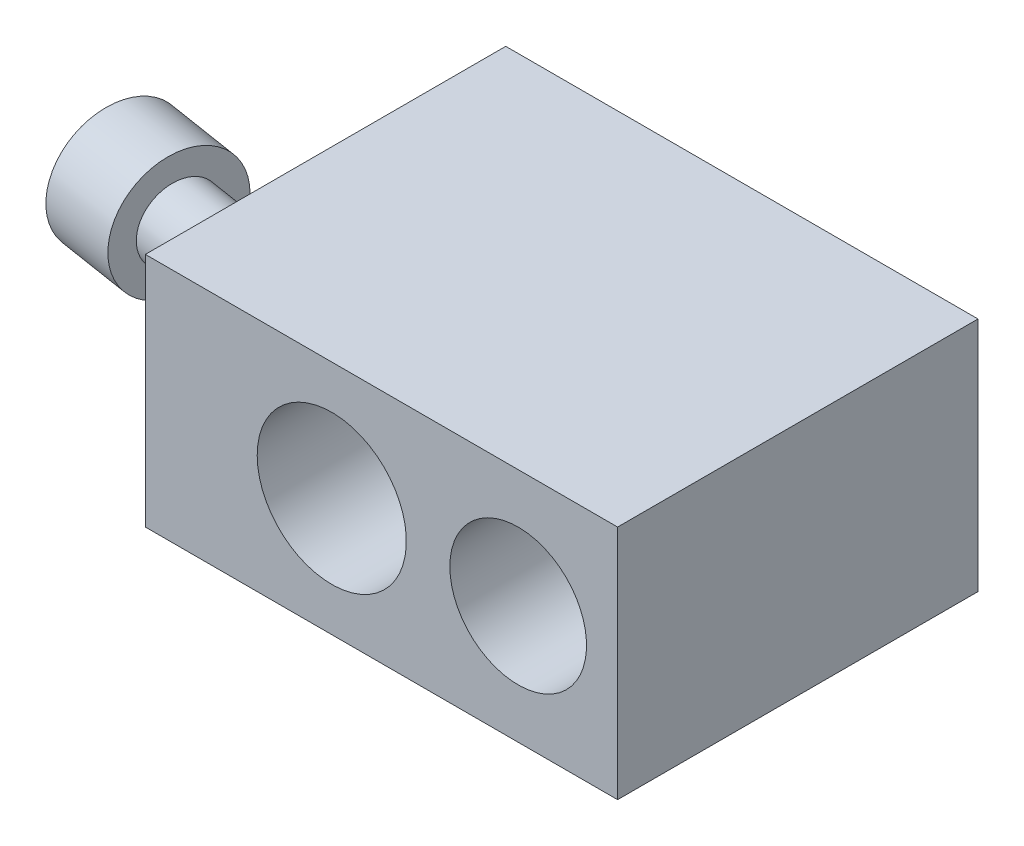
ISO-10303-21;
HEADER;
FILE_DESCRIPTION(('STEP AP214'),'2;1');
FILE_NAME('part.step','',(''),(''),'','','');
FILE_SCHEMA(('AUTOMOTIVE_DESIGN { 1 0 10303 214 1 1 1 1 }'));
ENDSEC;
DATA;
#1=APPLICATION_CONTEXT('core data for automotive mechanical design processes');
#2=APPLICATION_PROTOCOL_DEFINITION('international standard','automotive_design',2000,#1);
#3=PRODUCT_CONTEXT('',#1,'mechanical');
#4=PRODUCT('Part','Part','',(#3));
#5=PRODUCT_RELATED_PRODUCT_CATEGORY('part','',(#4));
#6=PRODUCT_DEFINITION_FORMATION('','',#4);
#7=PRODUCT_DEFINITION_CONTEXT('part definition',#1,'design');
#8=PRODUCT_DEFINITION('design','',#6,#7);
#9=PRODUCT_DEFINITION_SHAPE('','',#8);
#10=(LENGTH_UNIT() NAMED_UNIT(*) SI_UNIT(.MILLI.,.METRE.));
#11=(NAMED_UNIT(*) PLANE_ANGLE_UNIT() SI_UNIT($,.RADIAN.));
#12=(NAMED_UNIT(*) SI_UNIT($,.STERADIAN.) SOLID_ANGLE_UNIT());
#13=UNCERTAINTY_MEASURE_WITH_UNIT(LENGTH_MEASURE(1.E-05),#10,'distance_accuracy_value','');
#14=(GEOMETRIC_REPRESENTATION_CONTEXT(3) GLOBAL_UNCERTAINTY_ASSIGNED_CONTEXT((#13)) GLOBAL_UNIT_ASSIGNED_CONTEXT((#10,
#11,#12)) REPRESENTATION_CONTEXT('',''));
#15=CARTESIAN_POINT('',(0.,0.,0.));
#16=DIRECTION('',(0.,0.,1.));
#17=DIRECTION('',(1.,0.,0.));
#18=AXIS2_PLACEMENT_3D('',#15,#16,#17);
#19=CARTESIAN_POINT('',(-41.,0.,15.8577711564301));
#20=DIRECTION('',(-0.987688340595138,0.,-0.156434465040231));
#21=DIRECTION('',(0.156434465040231,0.,-0.987688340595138));
#22=AXIS2_PLACEMENT_3D('',#19,#20,#21);
#23=CYLINDRICAL_SURFACE('',#22,5.);
#24=CARTESIAN_POINT('',(-40.3337100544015,0.,15.9633011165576));
#25=DIRECTION('',(-0.987688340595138,0.,-0.156434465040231));
#26=DIRECTION('',(0.156434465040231,0.,-0.987688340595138));
#27=AXIS2_PLACEMENT_3D('',#24,#25,#26);
#28=CIRCLE('',#27,5.);
#29=CARTESIAN_POINT('',(-39.5515377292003,0.,11.0248594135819));
#30=VERTEX_POINT('',#29);
#31=EDGE_CURVE('E174',#30,#30,#28,.T.);
#32=ORIENTED_EDGE('',*,*,#31,.T.);
#33=EDGE_LOOP('',(#32));
#34=FACE_BOUND('',#33,.T.);
#35=CARTESIAN_POINT('',(-46.2598400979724,0.,15.0246943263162));
#36=DIRECTION('',(-0.987688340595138,0.,-0.156434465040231));
#37=DIRECTION('',(0.156434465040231,0.,-0.987688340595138));
#38=AXIS2_PLACEMENT_3D('',#35,#36,#37);
#39=CIRCLE('',#38,5.);
#40=CARTESIAN_POINT('',(-45.4776677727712,0.,10.0862526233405));
#41=VERTEX_POINT('',#40);
#42=EDGE_CURVE('E155',#41,#41,#39,.T.);
#43=ORIENTED_EDGE('',*,*,#42,.F.);
#44=EDGE_LOOP('',(#43));
#45=FACE_BOUND('',#44,.T.);
#46=ADVANCED_FACE('F14',(#34,#45),#23,.T.);
#47=CARTESIAN_POINT('',(-41.1158823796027,0.,20.9017428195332));
#48=DIRECTION('',(0.987688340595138,0.,0.156434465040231));
#49=DIRECTION('',(-0.156434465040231,0.,0.987688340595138));
#50=AXIS2_PLACEMENT_3D('',#47,#48,#49);
#51=PLANE('',#50);
#52=CARTESIAN_POINT('',(-40.3337100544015,0.,15.9633011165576));
#53=DIRECTION('',(-0.987688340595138,0.,-0.156434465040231));
#54=DIRECTION('',(0.156434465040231,0.,-0.987688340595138));
#55=AXIS2_PLACEMENT_3D('',#52,#53,#54);
#56=CIRCLE('',#55,3.);
#57=CARTESIAN_POINT('',(-39.8644066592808,0.,13.0002360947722));
#58=VERTEX_POINT('',#57);
#59=EDGE_CURVE('E171',#58,#58,#56,.T.);
#60=ORIENTED_EDGE('',*,*,#59,.T.);
#61=EDGE_LOOP('',(#60));
#62=FACE_BOUND('',#61,.T.);
#63=ORIENTED_EDGE('',*,*,#31,.F.);
#64=EDGE_LOOP('',(#63));
#65=FACE_BOUND('',#64,.T.);
#66=ADVANCED_FACE('F396',(#62,#65),#51,.T.);
#67=CARTESIAN_POINT('',(-41.,0.,15.8577711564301));
#68=DIRECTION('',(-0.987688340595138,0.,-0.156434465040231));
#69=DIRECTION('',(0.156434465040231,0.,-0.987688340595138));
#70=AXIS2_PLACEMENT_3D('',#67,#68,#69);
#71=CYLINDRICAL_SURFACE('',#70,3.);
#72=CARTESIAN_POINT('',(-30.,0.,17.6));
#73=DIRECTION('',(-1.,0.,0.));
#74=DIRECTION('',(0.,0.,-1.));
#75=AXIS2_PLACEMENT_3D('',#72,#73,#74);
#76=ELLIPSE('',#75,3.037395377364,3.);
#77=CARTESIAN_POINT('',(-30.,0.,14.562604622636));
#78=VERTEX_POINT('',#77);
#79=EDGE_CURVE('E24',#78,#78,#76,.T.);
#80=ORIENTED_EDGE('',*,*,#79,.T.);
#81=EDGE_LOOP('',(#80));
#82=FACE_BOUND('',#81,.T.);
#83=ORIENTED_EDGE('',*,*,#59,.F.);
#84=EDGE_LOOP('',(#83));
#85=FACE_BOUND('',#84,.T.);
#86=ADVANCED_FACE('F393',(#82,#85),#71,.T.);
#87=CARTESIAN_POINT('',(-47.0420124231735,0.,19.9631360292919));
#88=DIRECTION('',(0.987688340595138,0.,0.156434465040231));
#89=DIRECTION('',(-0.156434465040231,0.,0.987688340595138));
#90=AXIS2_PLACEMENT_3D('',#87,#88,#89);
#91=PLANE('',#90);
#92=DIRECTION('',(-0.135476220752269,0.5,0.855363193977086));
#93=VECTOR('',#92,1.);
#94=CARTESIAN_POINT('',(-46.2598400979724,-2.88675134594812,15.0246943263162));
#95=LINE('',#94,#93);
#96=CARTESIAN_POINT('',(-46.2598400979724,-2.88675134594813,15.0246943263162));
#97=VERTEX_POINT('',#96);
#98=CARTESIAN_POINT('',(-46.650926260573,-1.44337567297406,17.493915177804));
#99=VERTEX_POINT('',#98);
#100=EDGE_CURVE('E117',#97,#99,#95,.T.);
#101=ORIENTED_EDGE('',*,*,#100,.F.);
#102=DIRECTION('',(-0.135476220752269,-0.5,0.855363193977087));
#103=VECTOR('',#102,1.);
#104=CARTESIAN_POINT('',(-45.8687539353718,-1.44337567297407,12.5554734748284));
#105=LINE('',#104,#103);
#106=CARTESIAN_POINT('',(-45.8687539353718,-1.44337567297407,12.5554734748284));
#107=VERTEX_POINT('',#106);
#108=EDGE_CURVE('E33',#107,#97,#105,.T.);
#109=ORIENTED_EDGE('',*,*,#108,.F.);
#110=DIRECTION('',(0.,-1.,0.));
#111=VECTOR('',#110,1.);
#112=CARTESIAN_POINT('',(-45.8687539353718,1.44337567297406,12.5554734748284));
#113=LINE('',#112,#111);
#114=CARTESIAN_POINT('',(-45.8687539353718,1.44337567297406,12.5554734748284));
#115=VERTEX_POINT('',#114);
#116=EDGE_CURVE('E131',#115,#107,#113,.T.);
#117=ORIENTED_EDGE('',*,*,#116,.F.);
#118=DIRECTION('',(0.135476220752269,-0.5,-0.855363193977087));
#119=VECTOR('',#118,1.);
#120=CARTESIAN_POINT('',(-46.2598400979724,2.88675134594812,15.0246943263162));
#121=LINE('',#120,#119);
#122=CARTESIAN_POINT('',(-46.2598400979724,2.88675134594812,15.0246943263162));
#123=VERTEX_POINT('',#122);
#124=EDGE_CURVE('E128',#123,#115,#121,.T.);
#125=ORIENTED_EDGE('',*,*,#124,.F.);
#126=DIRECTION('',(0.135476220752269,0.5,-0.855363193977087));
#127=VECTOR('',#126,1.);
#128=CARTESIAN_POINT('',(-46.650926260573,1.44337567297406,17.493915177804));
#129=LINE('',#128,#127);
#130=CARTESIAN_POINT('',(-46.650926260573,1.44337567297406,17.493915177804));
#131=VERTEX_POINT('',#130);
#132=EDGE_CURVE('E125',#131,#123,#129,.T.);
#133=ORIENTED_EDGE('',*,*,#132,.F.);
#134=DIRECTION('',(0.,1.,0.));
#135=VECTOR('',#134,1.);
#136=CARTESIAN_POINT('',(-46.650926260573,-1.44337567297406,17.493915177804));
#137=LINE('',#136,#135);
#138=EDGE_CURVE('E120',#99,#131,#137,.T.);
#139=ORIENTED_EDGE('',*,*,#138,.F.);
#140=EDGE_LOOP('',(#101,#109,#117,#125,#133,#139));
#141=FACE_BOUND('',#140,.T.);
#142=ORIENTED_EDGE('',*,*,#42,.T.);
#143=EDGE_LOOP('',(#142));
#144=FACE_BOUND('',#143,.T.);
#145=ADVANCED_FACE('F356',(#141,#144),#91,.F.);
#146=CARTESIAN_POINT('',(8.,-9.5,29.));
#147=DIRECTION('',(0.,0.,-1.));
#148=DIRECTION('',(1.,0.,0.));
#149=AXIS2_PLACEMENT_3D('',#146,#147,#148);
#150=PLANE('',#149);
#151=CARTESIAN_POINT('',(0.,0.,29.));
#152=DIRECTION('',(0.,0.,1.));
#153=DIRECTION('',(-1.,0.,0.));
#154=AXIS2_PLACEMENT_3D('',#151,#152,#153);
#155=CIRCLE('',#154,5.5);
#156=CARTESIAN_POINT('',(-5.5,0.,29.));
#157=VERTEX_POINT('',#156);
#158=EDGE_CURVE('E192',#157,#157,#155,.T.);
#159=ORIENTED_EDGE('',*,*,#158,.F.);
#160=EDGE_LOOP('',(#159));
#161=FACE_BOUND('',#160,.T.);
#162=DIRECTION('',(0.,-1.,0.));
#163=VECTOR('',#162,1.);
#164=CARTESIAN_POINT('',(8.,9.5,29.));
#165=LINE('',#164,#163);
#166=CARTESIAN_POINT('',(8.,9.5,29.));
#167=VERTEX_POINT('',#166);
#168=CARTESIAN_POINT('',(8.,-9.5,29.));
#169=VERTEX_POINT('',#168);
#170=EDGE_CURVE('E208',#167,#169,#165,.T.);
#171=ORIENTED_EDGE('',*,*,#170,.F.);
#172=DIRECTION('',(1.,0.,0.));
#173=VECTOR('',#172,1.);
#174=CARTESIAN_POINT('',(-30.,9.5,29.));
#175=LINE('',#174,#173);
#176=CARTESIAN_POINT('',(-30.,9.5,29.));
#177=VERTEX_POINT('',#176);
#178=EDGE_CURVE('E199',#177,#167,#175,.T.);
#179=ORIENTED_EDGE('',*,*,#178,.F.);
#180=DIRECTION('',(0.,1.,0.));
#181=VECTOR('',#180,1.);
#182=CARTESIAN_POINT('',(-30.,-9.5,29.));
#183=LINE('',#182,#181);
#184=CARTESIAN_POINT('',(-30.,-9.5,29.));
#185=VERTEX_POINT('',#184);
#186=EDGE_CURVE('E215',#185,#177,#183,.T.);
#187=ORIENTED_EDGE('',*,*,#186,.F.);
#188=DIRECTION('',(-1.,0.,0.));
#189=VECTOR('',#188,1.);
#190=CARTESIAN_POINT('',(8.,-9.5,29.));
#191=LINE('',#190,#189);
#192=EDGE_CURVE('E212',#169,#185,#191,.T.);
#193=ORIENTED_EDGE('',*,*,#192,.F.);
#194=EDGE_LOOP('',(#171,#179,#187,#193));
#195=FACE_BOUND('',#194,.T.);
#196=CARTESIAN_POINT('',(-15.,0.,29.));
#197=DIRECTION('',(0.,0.,1.));
#198=DIRECTION('',(-1.,0.,0.));
#199=AXIS2_PLACEMENT_3D('',#196,#197,#198);
#200=CIRCLE('',#199,6.);
#201=CARTESIAN_POINT('',(-21.,0.,29.));
#202=VERTEX_POINT('',#201);
#203=EDGE_CURVE('E180',#202,#202,#200,.T.);
#204=ORIENTED_EDGE('',*,*,#203,.F.);
#205=EDGE_LOOP('',(#204));
#206=FACE_BOUND('',#205,.T.);
#207=ADVANCED_FACE('F303',(#161,#195,#206),#150,.F.);
#208=CARTESIAN_POINT('',(8.,-9.5,0.));
#209=DIRECTION('',(0.,0.,-1.));
#210=DIRECTION('',(1.,0.,0.));
#211=AXIS2_PLACEMENT_3D('',#208,#209,#210);
#212=PLANE('',#211);
#213=DIRECTION('',(0.,-1.,0.));
#214=VECTOR('',#213,1.);
#215=CARTESIAN_POINT('',(8.,9.5,0.));
#216=LINE('',#215,#214);
#217=CARTESIAN_POINT('',(8.,9.5,0.));
#218=VERTEX_POINT('',#217);
#219=CARTESIAN_POINT('',(8.,-9.5,0.));
#220=VERTEX_POINT('',#219);
#221=EDGE_CURVE('E196',#218,#220,#216,.T.);
#222=ORIENTED_EDGE('',*,*,#221,.T.);
#223=DIRECTION('',(-1.,0.,0.));
#224=VECTOR('',#223,1.);
#225=CARTESIAN_POINT('',(8.,-9.5,0.));
#226=LINE('',#225,#224);
#227=CARTESIAN_POINT('',(-30.,-9.5,0.));
#228=VERTEX_POINT('',#227);
#229=EDGE_CURVE('E200',#220,#228,#226,.T.);
#230=ORIENTED_EDGE('',*,*,#229,.T.);
#231=DIRECTION('',(0.,1.,0.));
#232=VECTOR('',#231,1.);
#233=CARTESIAN_POINT('',(-30.,-9.5,0.));
#234=LINE('',#233,#232);
#235=CARTESIAN_POINT('',(-30.,9.5,0.));
#236=VERTEX_POINT('',#235);
#237=EDGE_CURVE('E203',#228,#236,#234,.T.);
#238=ORIENTED_EDGE('',*,*,#237,.T.);
#239=DIRECTION('',(1.,0.,0.));
#240=VECTOR('',#239,1.);
#241=CARTESIAN_POINT('',(-30.,9.5,0.));
#242=LINE('',#241,#240);
#243=EDGE_CURVE('E195',#236,#218,#242,.T.);
#244=ORIENTED_EDGE('',*,*,#243,.T.);
#245=EDGE_LOOP('',(#222,#230,#238,#244));
#246=FACE_BOUND('',#245,.T.);
#247=CARTESIAN_POINT('',(0.,0.,0.));
#248=DIRECTION('',(0.,0.,1.));
#249=DIRECTION('',(-1.,0.,0.));
#250=AXIS2_PLACEMENT_3D('',#247,#248,#249);
#251=CIRCLE('',#250,3.3);
#252=CARTESIAN_POINT('',(-3.3,0.,0.));
#253=VERTEX_POINT('',#252);
#254=EDGE_CURVE('E183',#253,#253,#251,.T.);
#255=ORIENTED_EDGE('',*,*,#254,.T.);
#256=EDGE_LOOP('',(#255));
#257=FACE_BOUND('',#256,.T.);
#258=ADVANCED_FACE('F422',(#246,#257),#212,.T.);
#259=CARTESIAN_POINT('',(8.,9.5,29.));
#260=DIRECTION('',(1.,0.,0.));
#261=DIRECTION('',(0.,0.,1.));
#262=AXIS2_PLACEMENT_3D('',#259,#260,#261);
#263=PLANE('',#262);
#264=DIRECTION('',(0.,0.,-1.));
#265=VECTOR('',#264,1.);
#266=CARTESIAN_POINT('',(8.,9.5,29.));
#267=LINE('',#266,#265);
#268=EDGE_CURVE('E228',#167,#218,#267,.T.);
#269=ORIENTED_EDGE('',*,*,#268,.F.);
#270=ORIENTED_EDGE('',*,*,#170,.T.);
#271=DIRECTION('',(0.,0.,-1.));
#272=VECTOR('',#271,1.);
#273=CARTESIAN_POINT('',(8.,-9.5,29.));
#274=LINE('',#273,#272);
#275=EDGE_CURVE('E211',#169,#220,#274,.T.);
#276=ORIENTED_EDGE('',*,*,#275,.T.);
#277=ORIENTED_EDGE('',*,*,#221,.F.);
#278=EDGE_LOOP('',(#269,#270,#276,#277));
#279=FACE_BOUND('',#278,.T.);
#280=ADVANCED_FACE('F425',(#279),#263,.T.);
#281=CARTESIAN_POINT('',(-30.,9.5,29.));
#282=DIRECTION('',(0.,1.,0.));
#283=DIRECTION('',(-1.,0.,0.));
#284=AXIS2_PLACEMENT_3D('',#281,#282,#283);
#285=PLANE('',#284);
#286=DIRECTION('',(0.,0.,-1.));
#287=VECTOR('',#286,1.);
#288=CARTESIAN_POINT('',(-30.,9.5,29.));
#289=LINE('',#288,#287);
#290=EDGE_CURVE('E225',#177,#236,#289,.T.);
#291=ORIENTED_EDGE('',*,*,#290,.F.);
#292=ORIENTED_EDGE('',*,*,#178,.T.);
#293=ORIENTED_EDGE('',*,*,#268,.T.);
#294=ORIENTED_EDGE('',*,*,#243,.F.);
#295=EDGE_LOOP('',(#291,#292,#293,#294));
#296=FACE_BOUND('',#295,.T.);
#297=ADVANCED_FACE('F431',(#296),#285,.T.);
#298=CARTESIAN_POINT('',(-30.,-9.5,29.));
#299=DIRECTION('',(-1.,0.,0.));
#300=DIRECTION('',(0.,0.,-1.));
#301=AXIS2_PLACEMENT_3D('',#298,#299,#300);
#302=PLANE('',#301);
#303=ORIENTED_EDGE('',*,*,#79,.F.);
#304=EDGE_LOOP('',(#303));
#305=FACE_BOUND('',#304,.T.);
#306=DIRECTION('',(0.,0.,-1.));
#307=VECTOR('',#306,1.);
#308=CARTESIAN_POINT('',(-30.,-9.5,29.));
#309=LINE('',#308,#307);
#310=EDGE_CURVE('E222',#185,#228,#309,.T.);
#311=ORIENTED_EDGE('',*,*,#310,.F.);
#312=ORIENTED_EDGE('',*,*,#186,.T.);
#313=ORIENTED_EDGE('',*,*,#290,.T.);
#314=ORIENTED_EDGE('',*,*,#237,.F.);
#315=EDGE_LOOP('',(#311,#312,#313,#314));
#316=FACE_BOUND('',#315,.T.);
#317=ADVANCED_FACE('F292',(#305,#316),#302,.T.);
#318=CARTESIAN_POINT('',(8.,-9.5,29.));
#319=DIRECTION('',(0.,-1.,0.));
#320=DIRECTION('',(0.,0.,1.));
#321=AXIS2_PLACEMENT_3D('',#318,#319,#320);
#322=PLANE('',#321);
#323=CARTESIAN_POINT('',(-15.,-9.5,17.));
#324=DIRECTION('',(0.,-1.,0.));
#325=DIRECTION('',(0.,0.,1.));
#326=AXIS2_PLACEMENT_3D('',#323,#324,#325);
#327=CIRCLE('',#326,2.85);
#328=CARTESIAN_POINT('',(-15.,-9.5,19.85));
#329=VERTEX_POINT('',#328);
#330=EDGE_CURVE('E9',#329,#329,#327,.T.);
#331=ORIENTED_EDGE('',*,*,#330,.F.);
#332=EDGE_LOOP('',(#331));
#333=FACE_BOUND('',#332,.T.);
#334=ORIENTED_EDGE('',*,*,#192,.T.);
#335=ORIENTED_EDGE('',*,*,#310,.T.);
#336=ORIENTED_EDGE('',*,*,#229,.F.);
#337=ORIENTED_EDGE('',*,*,#275,.F.);
#338=EDGE_LOOP('',(#334,#335,#336,#337));
#339=FACE_BOUND('',#338,.T.);
#340=ADVANCED_FACE('F288',(#333,#339),#322,.T.);
#341=CARTESIAN_POINT('',(0.,0.,29.));
#342=DIRECTION('',(0.,0.,1.));
#343=DIRECTION('',(-1.,0.,0.));
#344=AXIS2_PLACEMENT_3D('',#341,#342,#343);
#345=CYLINDRICAL_SURFACE('',#344,5.5);
#346=ORIENTED_EDGE('',*,*,#158,.T.);
#347=EDGE_LOOP('',(#346));
#348=FACE_BOUND('',#347,.T.);
#349=CARTESIAN_POINT('',(0.,0.,15.));
#350=DIRECTION('',(0.,0.,1.));
#351=DIRECTION('',(-1.,0.,0.));
#352=AXIS2_PLACEMENT_3D('',#349,#350,#351);
#353=CIRCLE('',#352,5.5);
#354=CARTESIAN_POINT('',(-5.5,0.,15.));
#355=VERTEX_POINT('',#354);
#356=EDGE_CURVE('E189',#355,#355,#353,.T.);
#357=ORIENTED_EDGE('',*,*,#356,.F.);
#358=EDGE_LOOP('',(#357));
#359=FACE_BOUND('',#358,.T.);
#360=ADVANCED_FACE('F291',(#348,#359),#345,.F.);
#361=CARTESIAN_POINT('',(-3.3,0.,15.));
#362=DIRECTION('',(0.,0.,1.));
#363=DIRECTION('',(-1.,0.,0.));
#364=AXIS2_PLACEMENT_3D('',#361,#362,#363);
#365=PLANE('',#364);
#366=ORIENTED_EDGE('',*,*,#356,.T.);
#367=EDGE_LOOP('',(#366));
#368=FACE_BOUND('',#367,.T.);
#369=CARTESIAN_POINT('',(0.,0.,15.));
#370=DIRECTION('',(0.,0.,1.));
#371=DIRECTION('',(-1.,0.,0.));
#372=AXIS2_PLACEMENT_3D('',#369,#370,#371);
#373=CIRCLE('',#372,3.3);
#374=CARTESIAN_POINT('',(-3.3,0.,15.));
#375=VERTEX_POINT('',#374);
#376=EDGE_CURVE('E186',#375,#375,#373,.T.);
#377=ORIENTED_EDGE('',*,*,#376,.F.);
#378=EDGE_LOOP('',(#377));
#379=FACE_BOUND('',#378,.T.);
#380=ADVANCED_FACE('F414',(#368,#379),#365,.T.);
#381=CARTESIAN_POINT('',(0.,0.,29.));
#382=DIRECTION('',(0.,0.,1.));
#383=DIRECTION('',(-1.,0.,0.));
#384=AXIS2_PLACEMENT_3D('',#381,#382,#383);
#385=CYLINDRICAL_SURFACE('',#384,3.3);
#386=ORIENTED_EDGE('',*,*,#376,.T.);
#387=EDGE_LOOP('',(#386));
#388=FACE_BOUND('',#387,.T.);
#389=ORIENTED_EDGE('',*,*,#254,.F.);
#390=EDGE_LOOP('',(#389));
#391=FACE_BOUND('',#390,.T.);
#392=ADVANCED_FACE('F410',(#388,#391),#385,.F.);
#393=CARTESIAN_POINT('',(-15.,0.,29.));
#394=DIRECTION('',(0.,0.,1.));
#395=DIRECTION('',(-1.,0.,0.));
#396=AXIS2_PLACEMENT_3D('',#393,#394,#395);
#397=CYLINDRICAL_SURFACE('',#396,6.);
#398=ORIENTED_EDGE('',*,*,#203,.T.);
#399=EDGE_LOOP('',(#398));
#400=FACE_BOUND('',#399,.T.);
#401=CARTESIAN_POINT('',(-15.,0.,6.));
#402=DIRECTION('',(0.,0.,1.));
#403=DIRECTION('',(-1.,0.,0.));
#404=AXIS2_PLACEMENT_3D('',#401,#402,#403);
#405=CIRCLE('',#404,6.);
#406=CARTESIAN_POINT('',(-21.,0.,6.));
#407=VERTEX_POINT('',#406);
#408=EDGE_CURVE('E177',#407,#407,#405,.T.);
#409=ORIENTED_EDGE('',*,*,#408,.F.);
#410=EDGE_LOOP('',(#409));
#411=FACE_BOUND('',#410,.T.);
#412=ADVANCED_FACE('F406',(#400,#411),#397,.F.);
#413=CARTESIAN_POINT('',(-17.75,0.,6.));
#414=DIRECTION('',(0.,0.,1.));
#415=DIRECTION('',(-1.,0.,0.));
#416=AXIS2_PLACEMENT_3D('',#413,#414,#415);
#417=PLANE('',#416);
#418=ORIENTED_EDGE('',*,*,#408,.T.);
#419=EDGE_LOOP('',(#418));
#420=FACE_BOUND('',#419,.T.);
#421=ADVANCED_FACE('F390',(#420),#417,.T.);
#422=CARTESIAN_POINT('',(-42.9056889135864,-1.44337567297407,13.0247768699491));
#423=DIRECTION('',(0.0782172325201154,-0.866025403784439,-0.493844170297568));
#424=DIRECTION('',(0.,-0.495361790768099,0.868686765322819));
#425=AXIS2_PLACEMENT_3D('',#422,#423,#424);
#426=PLANE('',#425);
#427=ORIENTED_EDGE('',*,*,#108,.T.);
#428=DIRECTION('',(-0.987688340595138,0.,-0.156434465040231));
#429=VECTOR('',#428,1.);
#430=CARTESIAN_POINT('',(-43.296775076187,-2.88675134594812,15.4939977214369));
#431=LINE('',#430,#429);
#432=CARTESIAN_POINT('',(-43.296775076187,-2.88675134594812,15.4939977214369));
#433=VERTEX_POINT('',#432);
#434=EDGE_CURVE('E152',#433,#97,#431,.T.);
#435=ORIENTED_EDGE('',*,*,#434,.F.);
#436=DIRECTION('',(-0.135476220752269,-0.5,0.855363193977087));
#437=VECTOR('',#436,1.);
#438=CARTESIAN_POINT('',(-42.9056889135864,-1.44337567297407,13.0247768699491));
#439=LINE('',#438,#437);
#440=CARTESIAN_POINT('',(-42.9056889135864,-1.44337567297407,13.0247768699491));
#441=VERTEX_POINT('',#440);
#442=EDGE_CURVE('E134',#441,#433,#439,.T.);
#443=ORIENTED_EDGE('',*,*,#442,.F.);
#444=DIRECTION('',(-0.987688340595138,0.,-0.156434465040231));
#445=VECTOR('',#444,1.);
#446=CARTESIAN_POINT('',(-42.9056889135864,-1.44337567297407,13.0247768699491));
#447=LINE('',#446,#445);
#448=EDGE_CURVE('E153',#441,#107,#447,.T.);
#449=ORIENTED_EDGE('',*,*,#448,.T.);
#450=EDGE_LOOP('',(#427,#435,#443,#449));
#451=FACE_BOUND('',#450,.T.);
#452=ADVANCED_FACE('F368',(#451),#426,.F.);
#453=CARTESIAN_POINT('',(-42.9056889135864,1.44337567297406,13.0247768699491));
#454=DIRECTION('',(0.156434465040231,0.,-0.987688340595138));
#455=DIRECTION('',(0.987688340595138,0.,0.156434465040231));
#456=AXIS2_PLACEMENT_3D('',#453,#454,#455);
#457=PLANE('',#456);
#458=ORIENTED_EDGE('',*,*,#116,.T.);
#459=ORIENTED_EDGE('',*,*,#448,.F.);
#460=DIRECTION('',(0.,-1.,0.));
#461=VECTOR('',#460,1.);
#462=CARTESIAN_POINT('',(-42.9056889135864,1.44337567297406,13.0247768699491));
#463=LINE('',#462,#461);
#464=CARTESIAN_POINT('',(-42.9056889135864,1.44337567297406,13.0247768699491));
#465=VERTEX_POINT('',#464);
#466=EDGE_CURVE('E149',#465,#441,#463,.T.);
#467=ORIENTED_EDGE('',*,*,#466,.F.);
#468=DIRECTION('',(-0.987688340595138,0.,-0.156434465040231));
#469=VECTOR('',#468,1.);
#470=CARTESIAN_POINT('',(-42.9056889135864,1.44337567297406,13.0247768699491));
#471=LINE('',#470,#469);
#472=EDGE_CURVE('E156',#465,#115,#471,.T.);
#473=ORIENTED_EDGE('',*,*,#472,.T.);
#474=EDGE_LOOP('',(#458,#459,#467,#473));
#475=FACE_BOUND('',#474,.T.);
#476=ADVANCED_FACE('F370',(#475),#457,.F.);
#477=CARTESIAN_POINT('',(-43.296775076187,2.88675134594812,15.4939977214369));
#478=DIRECTION('',(0.0782172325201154,0.866025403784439,-0.493844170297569));
#479=DIRECTION('',(0.,-0.495361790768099,-0.868686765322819));
#480=AXIS2_PLACEMENT_3D('',#477,#478,#479);
#481=PLANE('',#480);
#482=ORIENTED_EDGE('',*,*,#124,.T.);
#483=ORIENTED_EDGE('',*,*,#472,.F.);
#484=DIRECTION('',(0.135476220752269,-0.5,-0.855363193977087));
#485=VECTOR('',#484,1.);
#486=CARTESIAN_POINT('',(-43.296775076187,2.88675134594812,15.4939977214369));
#487=LINE('',#486,#485);
#488=CARTESIAN_POINT('',(-43.296775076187,2.88675134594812,15.4939977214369));
#489=VERTEX_POINT('',#488);
#490=EDGE_CURVE('E146',#489,#465,#487,.T.);
#491=ORIENTED_EDGE('',*,*,#490,.F.);
#492=DIRECTION('',(-0.987688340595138,0.,-0.156434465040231));
#493=VECTOR('',#492,1.);
#494=CARTESIAN_POINT('',(-43.296775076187,2.88675134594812,15.4939977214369));
#495=LINE('',#494,#493);
#496=EDGE_CURVE('E159',#489,#123,#495,.T.);
#497=ORIENTED_EDGE('',*,*,#496,.T.);
#498=EDGE_LOOP('',(#482,#483,#491,#497));
#499=FACE_BOUND('',#498,.T.);
#500=ADVANCED_FACE('F372',(#499),#481,.F.);
#501=CARTESIAN_POINT('',(-43.6878612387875,1.44337567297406,17.9632185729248));
#502=DIRECTION('',(-0.0782172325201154,0.866025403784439,0.493844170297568));
#503=DIRECTION('',(0.,0.495361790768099,-0.868686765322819));
#504=AXIS2_PLACEMENT_3D('',#501,#502,#503);
#505=PLANE('',#504);
#506=ORIENTED_EDGE('',*,*,#132,.T.);
#507=ORIENTED_EDGE('',*,*,#496,.F.);
#508=DIRECTION('',(0.135476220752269,0.5,-0.855363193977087));
#509=VECTOR('',#508,1.);
#510=CARTESIAN_POINT('',(-43.6878612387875,1.44337567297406,17.9632185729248));
#511=LINE('',#510,#509);
#512=CARTESIAN_POINT('',(-43.6878612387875,1.44337567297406,17.9632185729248));
#513=VERTEX_POINT('',#512);
#514=EDGE_CURVE('E143',#513,#489,#511,.T.);
#515=ORIENTED_EDGE('',*,*,#514,.F.);
#516=DIRECTION('',(-0.987688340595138,0.,-0.156434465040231));
#517=VECTOR('',#516,1.);
#518=CARTESIAN_POINT('',(-43.6878612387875,1.44337567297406,17.9632185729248));
#519=LINE('',#518,#517);
#520=EDGE_CURVE('E162',#513,#131,#519,.T.);
#521=ORIENTED_EDGE('',*,*,#520,.T.);
#522=EDGE_LOOP('',(#506,#507,#515,#521));
#523=FACE_BOUND('',#522,.T.);
#524=ADVANCED_FACE('F361',(#523),#505,.F.);
#525=CARTESIAN_POINT('',(-43.6878612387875,-1.44337567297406,17.9632185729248));
#526=DIRECTION('',(-0.156434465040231,0.,0.987688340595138));
#527=DIRECTION('',(-0.987688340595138,0.,-0.156434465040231));
#528=AXIS2_PLACEMENT_3D('',#525,#526,#527);
#529=PLANE('',#528);
#530=ORIENTED_EDGE('',*,*,#138,.T.);
#531=ORIENTED_EDGE('',*,*,#520,.F.);
#532=DIRECTION('',(0.,1.,0.));
#533=VECTOR('',#532,1.);
#534=CARTESIAN_POINT('',(-43.6878612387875,-1.44337567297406,17.9632185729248));
#535=LINE('',#534,#533);
#536=CARTESIAN_POINT('',(-43.6878612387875,-1.44337567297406,17.9632185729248));
#537=VERTEX_POINT('',#536);
#538=EDGE_CURVE('E140',#537,#513,#535,.T.);
#539=ORIENTED_EDGE('',*,*,#538,.F.);
#540=DIRECTION('',(-0.987688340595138,0.,-0.156434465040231));
#541=VECTOR('',#540,1.);
#542=CARTESIAN_POINT('',(-43.6878612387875,-1.44337567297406,17.9632185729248));
#543=LINE('',#542,#541);
#544=EDGE_CURVE('E165',#537,#99,#543,.T.);
#545=ORIENTED_EDGE('',*,*,#544,.T.);
#546=EDGE_LOOP('',(#530,#531,#539,#545));
#547=FACE_BOUND('',#546,.T.);
#548=ADVANCED_FACE('F348',(#547),#529,.F.);
#549=CARTESIAN_POINT('',(-43.296775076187,-2.88675134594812,15.4939977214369));
#550=DIRECTION('',(-0.0782172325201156,-0.866025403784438,0.493844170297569));
#551=DIRECTION('',(0.,0.4953617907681,0.868686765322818));
#552=AXIS2_PLACEMENT_3D('',#549,#550,#551);
#553=PLANE('',#552);
#554=ORIENTED_EDGE('',*,*,#100,.T.);
#555=ORIENTED_EDGE('',*,*,#544,.F.);
#556=DIRECTION('',(-0.135476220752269,0.5,0.855363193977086));
#557=VECTOR('',#556,1.);
#558=CARTESIAN_POINT('',(-43.296775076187,-2.88675134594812,15.4939977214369));
#559=LINE('',#558,#557);
#560=EDGE_CURVE('E137',#433,#537,#559,.T.);
#561=ORIENTED_EDGE('',*,*,#560,.F.);
#562=ORIENTED_EDGE('',*,*,#434,.T.);
#563=EDGE_LOOP('',(#554,#555,#561,#562));
#564=FACE_BOUND('',#563,.T.);
#565=ADVANCED_FACE('F354',(#564),#553,.F.);
#566=CARTESIAN_POINT('',(-42.9056889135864,-1.44337567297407,13.0247768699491));
#567=DIRECTION('',(0.987688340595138,0.,0.156434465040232));
#568=DIRECTION('',(-0.156434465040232,0.,0.987688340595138));
#569=AXIS2_PLACEMENT_3D('',#566,#567,#568);
#570=PLANE('',#569);
#571=ORIENTED_EDGE('',*,*,#442,.T.);
#572=ORIENTED_EDGE('',*,*,#560,.T.);
#573=ORIENTED_EDGE('',*,*,#538,.T.);
#574=ORIENTED_EDGE('',*,*,#514,.T.);
#575=ORIENTED_EDGE('',*,*,#490,.T.);
#576=ORIENTED_EDGE('',*,*,#466,.T.);
#577=EDGE_LOOP('',(#571,#572,#573,#574,#575,#576));
#578=FACE_BOUND('',#577,.T.);
#579=ADVANCED_FACE('F365',(#578),#570,.F.);
#580=CARTESIAN_POINT('',(-15.,-10.11,17.));
#581=DIRECTION('',(0.,1.,0.));
#582=DIRECTION('',(-1.,0.,0.));
#583=AXIS2_PLACEMENT_3D('',#580,#581,#582);
#584=PLANE('',#583);
#585=DIRECTION('',(0.,0.,1.));
#586=VECTOR('',#585,1.);
#587=CARTESIAN_POINT('',(-16.,-10.11,16.4226497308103));
#588=LINE('',#587,#586);
#589=CARTESIAN_POINT('',(-16.,-10.11,16.4226497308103));
#590=VERTEX_POINT('',#589);
#591=CARTESIAN_POINT('',(-16.,-10.11,17.5773502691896));
#592=VERTEX_POINT('',#591);
#593=EDGE_CURVE('E243',#590,#592,#588,.T.);
#594=ORIENTED_EDGE('',*,*,#593,.F.);
#595=DIRECTION('',(-0.866025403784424,0.,0.50000000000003));
#596=VECTOR('',#595,1.);
#597=CARTESIAN_POINT('',(-15.,-10.11,15.8452994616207));
#598=LINE('',#597,#596);
#599=CARTESIAN_POINT('',(-15.,-10.11,15.8452994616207));
#600=VERTEX_POINT('',#599);
#601=EDGE_CURVE('E241',#600,#590,#598,.T.);
#602=ORIENTED_EDGE('',*,*,#601,.F.);
#603=DIRECTION('',(-0.866025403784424,0.,-0.50000000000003));
#604=VECTOR('',#603,1.);
#605=CARTESIAN_POINT('',(-14.,-10.11,16.4226497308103));
#606=LINE('',#605,#604);
#607=CARTESIAN_POINT('',(-14.,-10.11,16.4226497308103));
#608=VERTEX_POINT('',#607);
#609=EDGE_CURVE('E238',#608,#600,#606,.T.);
#610=ORIENTED_EDGE('',*,*,#609,.F.);
#611=DIRECTION('',(0.,0.,-1.));
#612=VECTOR('',#611,1.);
#613=CARTESIAN_POINT('',(-14.,-10.11,17.5773502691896));
#614=LINE('',#613,#612);
#615=CARTESIAN_POINT('',(-14.,-10.11,17.5773502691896));
#616=VERTEX_POINT('',#615);
#617=EDGE_CURVE('E235',#616,#608,#614,.T.);
#618=ORIENTED_EDGE('',*,*,#617,.F.);
#619=DIRECTION('',(0.866025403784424,0.,-0.50000000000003));
#620=VECTOR('',#619,1.);
#621=CARTESIAN_POINT('',(-15.,-10.11,18.1547005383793));
#622=LINE('',#621,#620);
#623=CARTESIAN_POINT('',(-15.,-10.11,18.1547005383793));
#624=VERTEX_POINT('',#623);
#625=EDGE_CURVE('E233',#624,#616,#622,.T.);
#626=ORIENTED_EDGE('',*,*,#625,.F.);
#627=DIRECTION('',(0.866025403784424,0.,0.50000000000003));
#628=VECTOR('',#627,1.);
#629=CARTESIAN_POINT('',(-16.,-10.11,17.5773502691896));
#630=LINE('',#629,#628);
#631=EDGE_CURVE('E98',#592,#624,#630,.T.);
#632=ORIENTED_EDGE('',*,*,#631,.F.);
#633=EDGE_LOOP('',(#594,#602,#610,#618,#626,#632));
#634=FACE_BOUND('',#633,.T.);
#635=ADVANCED_FACE('F261',(#634),#584,.F.);
#636=CARTESIAN_POINT('',(-14.,-10.11,17.5773502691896));
#637=DIRECTION('',(-1.,0.,0.));
#638=DIRECTION('',(0.,-1.,0.));
#639=AXIS2_PLACEMENT_3D('',#636,#637,#638);
#640=PLANE('',#639);
#641=DIRECTION('',(0.,-1.,0.));
#642=VECTOR('',#641,1.);
#643=CARTESIAN_POINT('',(-14.,-10.11,17.5773502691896));
#644=LINE('',#643,#642);
#645=CARTESIAN_POINT('',(-14.,-11.15,17.5773502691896));
#646=VERTEX_POINT('',#645);
#647=EDGE_CURVE('E89',#616,#646,#644,.T.);
#648=ORIENTED_EDGE('',*,*,#647,.F.);
#649=ORIENTED_EDGE('',*,*,#617,.T.);
#650=DIRECTION('',(0.,-1.,0.));
#651=VECTOR('',#650,1.);
#652=CARTESIAN_POINT('',(-14.,-10.11,16.4226497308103));
#653=LINE('',#652,#651);
#654=CARTESIAN_POINT('',(-14.,-11.15,16.4226497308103));
#655=VERTEX_POINT('',#654);
#656=EDGE_CURVE('E252',#608,#655,#653,.T.);
#657=ORIENTED_EDGE('',*,*,#656,.T.);
#658=DIRECTION('',(0.,0.,1.));
#659=VECTOR('',#658,1.);
#660=CARTESIAN_POINT('',(-14.,-11.15,18.));
#661=LINE('',#660,#659);
#662=EDGE_CURVE('E111',#655,#646,#661,.T.);
#663=ORIENTED_EDGE('',*,*,#662,.T.);
#664=EDGE_LOOP('',(#648,#649,#657,#663));
#665=FACE_BOUND('',#664,.T.);
#666=ADVANCED_FACE('F253',(#665),#640,.T.);
#667=CARTESIAN_POINT('',(-15.,-10.11,18.1547005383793));
#668=DIRECTION('',(-0.50000000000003,0.,-0.866025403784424));
#669=DIRECTION('',(-0.866025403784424,0.,0.50000000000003));
#670=AXIS2_PLACEMENT_3D('',#667,#668,#669);
#671=PLANE('',#670);
#672=DIRECTION('',(0.,-1.,0.));
#673=VECTOR('',#672,1.);
#674=CARTESIAN_POINT('',(-15.,-10.11,18.1547005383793));
#675=LINE('',#674,#673);
#676=CARTESIAN_POINT('',(-15.,-11.15,18.1547005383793));
#677=VERTEX_POINT('',#676);
#678=EDGE_CURVE('E87',#624,#677,#675,.T.);
#679=ORIENTED_EDGE('',*,*,#678,.F.);
#680=ORIENTED_EDGE('',*,*,#625,.T.);
#681=ORIENTED_EDGE('',*,*,#647,.T.);
#682=DIRECTION('',(-0.866025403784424,0.,0.50000000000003));
#683=VECTOR('',#682,1.);
#684=CARTESIAN_POINT('',(-14.9330127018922,-11.15,18.1160254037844));
#685=LINE('',#684,#683);
#686=EDGE_CURVE('E84',#646,#677,#685,.T.);
#687=ORIENTED_EDGE('',*,*,#686,.T.);
#688=EDGE_LOOP('',(#679,#680,#681,#687));
#689=FACE_BOUND('',#688,.T.);
#690=ADVANCED_FACE('F85',(#689),#671,.T.);
#691=CARTESIAN_POINT('',(-16.,-10.11,17.5773502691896));
#692=DIRECTION('',(0.50000000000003,0.,-0.866025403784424));
#693=DIRECTION('',(-0.866025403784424,0.,-0.50000000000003));
#694=AXIS2_PLACEMENT_3D('',#691,#692,#693);
#695=PLANE('',#694);
#696=DIRECTION('',(0.,-1.,0.));
#697=VECTOR('',#696,1.);
#698=CARTESIAN_POINT('',(-16.,-10.11,17.5773502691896));
#699=LINE('',#698,#697);
#700=CARTESIAN_POINT('',(-16.,-11.15,17.5773502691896));
#701=VERTEX_POINT('',#700);
#702=EDGE_CURVE('E99',#592,#701,#699,.T.);
#703=ORIENTED_EDGE('',*,*,#702,.F.);
#704=ORIENTED_EDGE('',*,*,#631,.T.);
#705=ORIENTED_EDGE('',*,*,#678,.T.);
#706=DIRECTION('',(-0.866025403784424,0.,-0.50000000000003));
#707=VECTOR('',#706,1.);
#708=CARTESIAN_POINT('',(-15.0669872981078,-11.15,18.1160254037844));
#709=LINE('',#708,#707);
#710=EDGE_CURVE('E77',#677,#701,#709,.T.);
#711=ORIENTED_EDGE('',*,*,#710,.T.);
#712=EDGE_LOOP('',(#703,#704,#705,#711));
#713=FACE_BOUND('',#712,.T.);
#714=ADVANCED_FACE('F96',(#713),#695,.T.);
#715=CARTESIAN_POINT('',(-16.,-10.11,16.4226497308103));
#716=DIRECTION('',(1.,0.,0.));
#717=DIRECTION('',(0.,1.,0.));
#718=AXIS2_PLACEMENT_3D('',#715,#716,#717);
#719=PLANE('',#718);
#720=ORIENTED_EDGE('',*,*,#593,.T.);
#721=ORIENTED_EDGE('',*,*,#702,.T.);
#722=DIRECTION('',(0.,0.,-1.));
#723=VECTOR('',#722,1.);
#724=CARTESIAN_POINT('',(-16.,-11.15,18.));
#725=LINE('',#724,#723);
#726=CARTESIAN_POINT('',(-16.,-11.15,16.4226497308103));
#727=VERTEX_POINT('',#726);
#728=EDGE_CURVE('E93',#701,#727,#725,.T.);
#729=ORIENTED_EDGE('',*,*,#728,.T.);
#730=DIRECTION('',(0.,-1.,0.));
#731=VECTOR('',#730,1.);
#732=CARTESIAN_POINT('',(-16.,-10.11,16.4226497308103));
#733=LINE('',#732,#731);
#734=EDGE_CURVE('E247',#590,#727,#733,.T.);
#735=ORIENTED_EDGE('',*,*,#734,.F.);
#736=EDGE_LOOP('',(#720,#721,#729,#735));
#737=FACE_BOUND('',#736,.T.);
#738=ADVANCED_FACE('F263',(#737),#719,.T.);
#739=CARTESIAN_POINT('',(-15.,-10.11,15.8452994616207));
#740=DIRECTION('',(0.50000000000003,0.,0.866025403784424));
#741=DIRECTION('',(0.866025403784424,0.,-0.50000000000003));
#742=AXIS2_PLACEMENT_3D('',#739,#740,#741);
#743=PLANE('',#742);
#744=DIRECTION('',(0.,-1.,0.));
#745=VECTOR('',#744,1.);
#746=CARTESIAN_POINT('',(-15.,-10.11,15.8452994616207));
#747=LINE('',#746,#745);
#748=CARTESIAN_POINT('',(-15.,-11.15,15.8452994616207));
#749=VERTEX_POINT('',#748);
#750=EDGE_CURVE('E250',#600,#749,#747,.T.);
#751=ORIENTED_EDGE('',*,*,#750,.F.);
#752=ORIENTED_EDGE('',*,*,#601,.T.);
#753=ORIENTED_EDGE('',*,*,#734,.T.);
#754=DIRECTION('',(0.866025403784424,0.,-0.50000000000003));
#755=VECTOR('',#754,1.);
#756=CARTESIAN_POINT('',(-15.9330127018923,-11.15,16.3839745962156));
#757=LINE('',#756,#755);
#758=EDGE_CURVE('E92',#727,#749,#757,.T.);
#759=ORIENTED_EDGE('',*,*,#758,.T.);
#760=EDGE_LOOP('',(#751,#752,#753,#759));
#761=FACE_BOUND('',#760,.T.);
#762=ADVANCED_FACE('F256',(#761),#743,.T.);
#763=CARTESIAN_POINT('',(-14.,-10.11,16.4226497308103));
#764=DIRECTION('',(-0.50000000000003,0.,0.866025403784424));
#765=DIRECTION('',(0.866025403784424,0.,0.50000000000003));
#766=AXIS2_PLACEMENT_3D('',#763,#764,#765);
#767=PLANE('',#766);
#768=ORIENTED_EDGE('',*,*,#656,.F.);
#769=ORIENTED_EDGE('',*,*,#609,.T.);
#770=ORIENTED_EDGE('',*,*,#750,.T.);
#771=DIRECTION('',(0.866025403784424,0.,0.50000000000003));
#772=VECTOR('',#771,1.);
#773=CARTESIAN_POINT('',(-14.0669872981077,-11.15,16.3839745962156));
#774=LINE('',#773,#772);
#775=EDGE_CURVE('E18',#749,#655,#774,.T.);
#776=ORIENTED_EDGE('',*,*,#775,.T.);
#777=EDGE_LOOP('',(#768,#769,#770,#776));
#778=FACE_BOUND('',#777,.T.);
#779=ADVANCED_FACE('F258',(#778),#767,.T.);
#780=CARTESIAN_POINT('',(-15.,-11.15,18.));
#781=DIRECTION('',(0.,1.,0.));
#782=DIRECTION('',(-1.,0.,0.));
#783=AXIS2_PLACEMENT_3D('',#780,#781,#782);
#784=PLANE('',#783);
#785=CARTESIAN_POINT('',(-15.,-11.15,17.));
#786=DIRECTION('',(0.,1.,0.));
#787=DIRECTION('',(-1.,0.,0.));
#788=AXIS2_PLACEMENT_3D('',#785,#786,#787);
#789=CIRCLE('',#788,1.925);
#790=CARTESIAN_POINT('',(-16.925,-11.15,17.));
#791=VERTEX_POINT('',#790);
#792=EDGE_CURVE('E104',#791,#791,#789,.T.);
#793=ORIENTED_EDGE('',*,*,#792,.F.);
#794=EDGE_LOOP('',(#793));
#795=FACE_BOUND('',#794,.T.);
#796=ORIENTED_EDGE('',*,*,#775,.F.);
#797=ORIENTED_EDGE('',*,*,#758,.F.);
#798=ORIENTED_EDGE('',*,*,#728,.F.);
#799=ORIENTED_EDGE('',*,*,#710,.F.);
#800=ORIENTED_EDGE('',*,*,#686,.F.);
#801=ORIENTED_EDGE('',*,*,#662,.F.);
#802=EDGE_LOOP('',(#796,#797,#798,#799,#800,#801));
#803=FACE_BOUND('',#802,.T.);
#804=ADVANCED_FACE('F16',(#795,#803),#784,.F.);
#805=CARTESIAN_POINT('',(-15.,-9.01031377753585,17.));
#806=DIRECTION('',(0.,1.,0.));
#807=DIRECTION('',(-1.,0.,0.));
#808=AXIS2_PLACEMENT_3D('',#805,#806,#807);
#809=DEGENERATE_TOROIDAL_SURFACE('',#808,0.0423840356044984,2.84999999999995,.T.);
#810=ORIENTED_EDGE('',*,*,#792,.T.);
#811=EDGE_LOOP('',(#810));
#812=FACE_BOUND('',#811,.T.);
#813=ORIENTED_EDGE('',*,*,#330,.T.);
#814=EDGE_LOOP('',(#813));
#815=FACE_BOUND('',#814,.T.);
#816=ADVANCED_FACE('F275',(#812,#815),#809,.T.);
#817=CLOSED_SHELL('',(#46,#66,#86,#145,#207,#258,#280,#297,#317,#340,#360,#380,#392,#412,#421,
#452,#476,#500,#524,#548,#565,#579,#635,#666,#690,#714,#738,#762,#779,#804,#816));
#818=MANIFOLD_SOLID_BREP('B1',#817);
#819=ADVANCED_BREP_SHAPE_REPRESENTATION('',(#18,#818),#14);
#820=SHAPE_DEFINITION_REPRESENTATION(#9,#819);
ENDSEC;
END-ISO-10303-21;
